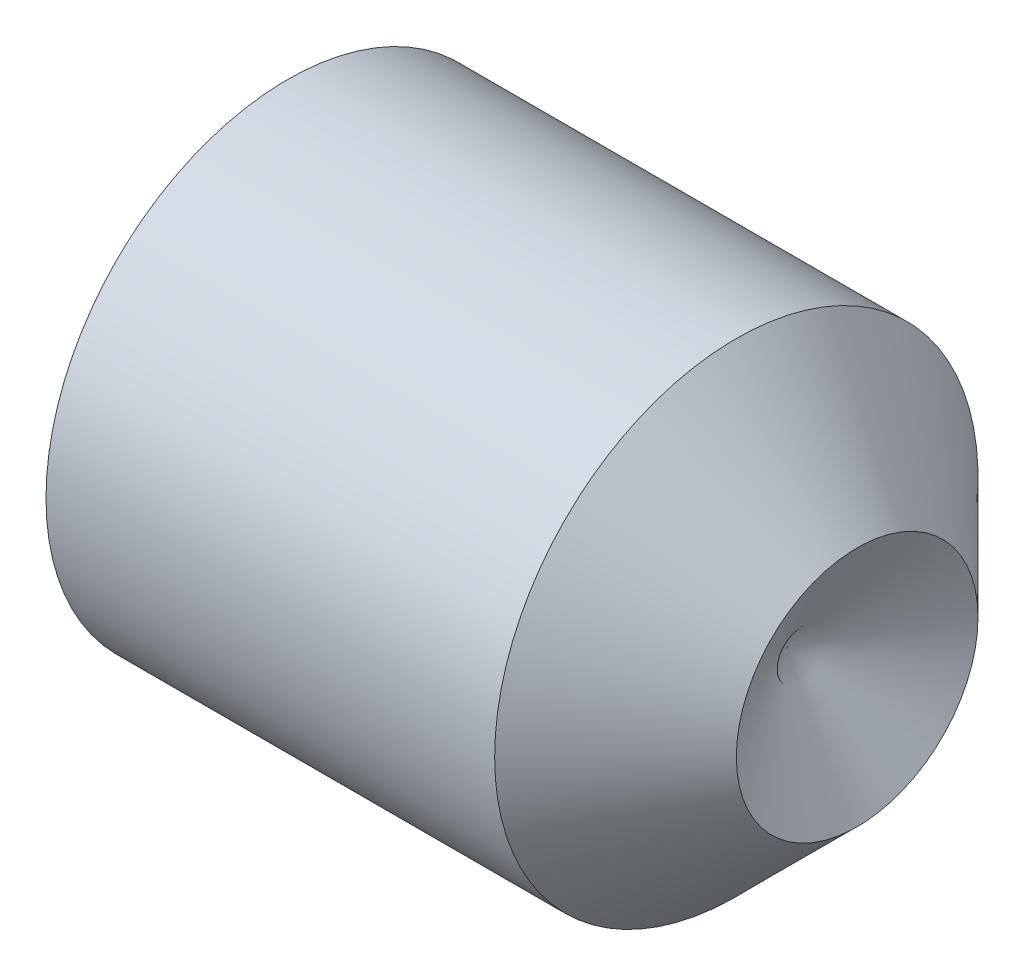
ISO-10303-21;
HEADER;
FILE_DESCRIPTION(('STEP AP214'),'2;1');
FILE_NAME('part.step','',(''),(''),'','','');
FILE_SCHEMA(('AUTOMOTIVE_DESIGN { 1 0 10303 214 1 1 1 1 }'));
ENDSEC;
DATA;
#1=APPLICATION_CONTEXT('core data for automotive mechanical design processes');
#2=APPLICATION_PROTOCOL_DEFINITION('international standard','automotive_design',2000,#1);
#3=PRODUCT_CONTEXT('',#1,'mechanical');
#4=PRODUCT('Part','Part','',(#3));
#5=PRODUCT_RELATED_PRODUCT_CATEGORY('part','',(#4));
#6=PRODUCT_DEFINITION_FORMATION('','',#4);
#7=PRODUCT_DEFINITION_CONTEXT('part definition',#1,'design');
#8=PRODUCT_DEFINITION('design','',#6,#7);
#9=PRODUCT_DEFINITION_SHAPE('','',#8);
#10=(LENGTH_UNIT() NAMED_UNIT(*) SI_UNIT(.MILLI.,.METRE.));
#11=(NAMED_UNIT(*) PLANE_ANGLE_UNIT() SI_UNIT($,.RADIAN.));
#12=(NAMED_UNIT(*) SI_UNIT($,.STERADIAN.) SOLID_ANGLE_UNIT());
#13=UNCERTAINTY_MEASURE_WITH_UNIT(LENGTH_MEASURE(1.E-05),#10,'distance_accuracy_value','');
#14=(GEOMETRIC_REPRESENTATION_CONTEXT(3) GLOBAL_UNCERTAINTY_ASSIGNED_CONTEXT((#13)) GLOBAL_UNIT_ASSIGNED_CONTEXT((#10,
#11,#12)) REPRESENTATION_CONTEXT('',''));
#15=CARTESIAN_POINT('',(0.,0.,0.));
#16=DIRECTION('',(0.,0.,1.));
#17=DIRECTION('',(1.,0.,0.));
#18=AXIS2_PLACEMENT_3D('',#15,#16,#17);
#19=CARTESIAN_POINT('',(0.,0.,0.));
#20=DIRECTION('',(-1.,0.,0.));
#21=DIRECTION('',(0.,0.,1.));
#22=AXIS2_PLACEMENT_3D('',#19,#20,#21);
#23=CYLINDRICAL_SURFACE('',#22,0.799999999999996);
#24=CARTESIAN_POINT('',(1.6,0.,0.));
#25=DIRECTION('',(-1.,0.,0.));
#26=DIRECTION('',(0.,0.,1.));
#27=AXIS2_PLACEMENT_3D('',#24,#25,#26);
#28=CIRCLE('',#27,0.8);
#29=CARTESIAN_POINT('',(1.6,0.,0.8));
#30=VERTEX_POINT('',#29);
#31=EDGE_CURVE('E11',#30,#30,#28,.T.);
#32=ORIENTED_EDGE('',*,*,#31,.T.);
#33=EDGE_LOOP('',(#32));
#34=FACE_BOUND('',#33,.T.);
#35=CARTESIAN_POINT('',(0.114892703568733,0.,0.));
#36=DIRECTION('',(-1.,0.,0.));
#37=DIRECTION('',(0.,0.,1.));
#38=AXIS2_PLACEMENT_3D('',#35,#36,#37);
#39=CIRCLE('',#38,0.799999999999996);
#40=CARTESIAN_POINT('',(0.114892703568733,0.,0.799999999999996));
#41=VERTEX_POINT('',#40);
#42=EDGE_CURVE('E52',#41,#41,#39,.T.);
#43=ORIENTED_EDGE('',*,*,#42,.F.);
#44=EDGE_LOOP('',(#43));
#45=FACE_BOUND('',#44,.T.);
#46=ADVANCED_FACE('F44',(#34,#45),#23,.T.);
#47=CARTESIAN_POINT('',(2.,0.,0.));
#48=DIRECTION('',(-1.,0.,0.));
#49=DIRECTION('',(0.,0.,1.));
#50=AXIS2_PLACEMENT_3D('',#47,#48,#49);
#51=CONICAL_SURFACE('',#50,0.4,0.785398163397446);
#52=ORIENTED_EDGE('',*,*,#31,.F.);
#53=EDGE_LOOP('',(#52));
#54=FACE_BOUND('',#53,.T.);
#55=CARTESIAN_POINT('',(2.,0.,0.));
#56=DIRECTION('',(-1.,0.,0.));
#57=DIRECTION('',(0.,0.,1.));
#58=AXIS2_PLACEMENT_3D('',#55,#56,#57);
#59=CIRCLE('',#58,0.4);
#60=CARTESIAN_POINT('',(2.,0.,0.4));
#61=VERTEX_POINT('',#60);
#62=EDGE_CURVE('E140',#61,#61,#59,.T.);
#63=ORIENTED_EDGE('',*,*,#62,.T.);
#64=EDGE_LOOP('',(#63));
#65=FACE_BOUND('',#64,.T.);
#66=ADVANCED_FACE('F165',(#54,#65),#51,.T.);
#67=CARTESIAN_POINT('',(0.,0.,0.));
#68=DIRECTION('',(1.,0.,0.));
#69=DIRECTION('',(0.,0.,-1.));
#70=AXIS2_PLACEMENT_3D('',#67,#68,#69);
#71=CONICAL_SURFACE('',#70,0.601,1.0471975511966);
#72=ORIENTED_EDGE('',*,*,#42,.T.);
#73=EDGE_LOOP('',(#72));
#74=FACE_BOUND('',#73,.T.);
#75=CARTESIAN_POINT('',(0.,0.,0.));
#76=DIRECTION('',(-1.,0.,0.));
#77=DIRECTION('',(0.,0.,1.));
#78=AXIS2_PLACEMENT_3D('',#75,#76,#77);
#79=CIRCLE('',#78,0.601);
#80=CARTESIAN_POINT('',(0.,0.,0.601));
#81=VERTEX_POINT('',#80);
#82=EDGE_CURVE('E150',#81,#81,#79,.T.);
#83=ORIENTED_EDGE('',*,*,#82,.F.);
#84=EDGE_LOOP('',(#83));
#85=FACE_BOUND('',#84,.T.);
#86=ADVANCED_FACE('F159',(#74,#85),#71,.T.);
#87=CARTESIAN_POINT('',(0.,0.799999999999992,0.));
#88=DIRECTION('',(1.,0.,0.));
#89=DIRECTION('',(0.,0.,-1.));
#90=AXIS2_PLACEMENT_3D('',#87,#88,#89);
#91=PLANE('',#90);
#92=DIRECTION('',(0.,-0.5,-0.866025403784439));
#93=VECTOR('',#92,1.);
#94=CARTESIAN_POINT('',(0.,0.404145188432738,0.));
#95=LINE('',#94,#93);
#96=CARTESIAN_POINT('',(0.,0.404145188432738,0.));
#97=VERTEX_POINT('',#96);
#98=CARTESIAN_POINT('',(0.,0.202072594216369,-0.35));
#99=VERTEX_POINT('',#98);
#100=EDGE_CURVE('E138',#97,#99,#95,.T.);
#101=ORIENTED_EDGE('',*,*,#100,.F.);
#102=DIRECTION('',(0.,0.5,-0.866025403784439));
#103=VECTOR('',#102,1.);
#104=CARTESIAN_POINT('',(0.,0.202072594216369,0.35));
#105=LINE('',#104,#103);
#106=CARTESIAN_POINT('',(0.,0.202072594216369,0.35));
#107=VERTEX_POINT('',#106);
#108=EDGE_CURVE('E58',#107,#97,#105,.T.);
#109=ORIENTED_EDGE('',*,*,#108,.F.);
#110=DIRECTION('',(0.,1.,0.));
#111=VECTOR('',#110,1.);
#112=CARTESIAN_POINT('',(0.,-0.202072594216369,0.35));
#113=LINE('',#112,#111);
#114=CARTESIAN_POINT('',(0.,-0.202072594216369,0.35));
#115=VERTEX_POINT('',#114);
#116=EDGE_CURVE('E146',#115,#107,#113,.T.);
#117=ORIENTED_EDGE('',*,*,#116,.F.);
#118=DIRECTION('',(0.,0.5,0.866025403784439));
#119=VECTOR('',#118,1.);
#120=CARTESIAN_POINT('',(0.,-0.404145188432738,0.));
#121=LINE('',#120,#119);
#122=CARTESIAN_POINT('',(0.,-0.404145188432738,0.));
#123=VERTEX_POINT('',#122);
#124=EDGE_CURVE('E144',#123,#115,#121,.T.);
#125=ORIENTED_EDGE('',*,*,#124,.F.);
#126=DIRECTION('',(0.,-0.5,0.866025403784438));
#127=VECTOR('',#126,1.);
#128=CARTESIAN_POINT('',(0.,-0.202072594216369,-0.35));
#129=LINE('',#128,#127);
#130=CARTESIAN_POINT('',(0.,-0.202072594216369,-0.35));
#131=VERTEX_POINT('',#130);
#132=EDGE_CURVE('E109',#131,#123,#129,.T.);
#133=ORIENTED_EDGE('',*,*,#132,.F.);
#134=DIRECTION('',(0.,-1.,0.));
#135=VECTOR('',#134,1.);
#136=CARTESIAN_POINT('',(0.,0.202072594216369,-0.35));
#137=LINE('',#136,#135);
#138=EDGE_CURVE('E139',#99,#131,#137,.T.);
#139=ORIENTED_EDGE('',*,*,#138,.F.);
#140=EDGE_LOOP('',(#101,#109,#117,#125,#133,#139));
#141=FACE_BOUND('',#140,.T.);
#142=ORIENTED_EDGE('',*,*,#82,.T.);
#143=EDGE_LOOP('',(#142));
#144=FACE_BOUND('',#143,.T.);
#145=ADVANCED_FACE('F50',(#141,#144),#91,.F.);
#146=CARTESIAN_POINT('',(0.7,0.202072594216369,0.35));
#147=DIRECTION('',(0.,0.866025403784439,0.5));
#148=DIRECTION('',(0.,-0.5,0.866025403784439));
#149=AXIS2_PLACEMENT_3D('',#146,#147,#148);
#150=PLANE('',#149);
#151=ORIENTED_EDGE('',*,*,#108,.T.);
#152=DIRECTION('',(-1.,0.,0.));
#153=VECTOR('',#152,1.);
#154=CARTESIAN_POINT('',(0.7,0.404145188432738,0.));
#155=LINE('',#154,#153);
#156=CARTESIAN_POINT('',(0.7,0.404145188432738,0.));
#157=VERTEX_POINT('',#156);
#158=EDGE_CURVE('E93',#157,#97,#155,.T.);
#159=ORIENTED_EDGE('',*,*,#158,.F.);
#160=DIRECTION('',(0.,0.5,-0.866025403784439));
#161=VECTOR('',#160,1.);
#162=CARTESIAN_POINT('',(0.7,0.202072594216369,0.35));
#163=LINE('',#162,#161);
#164=CARTESIAN_POINT('',(0.7,0.202072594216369,0.35));
#165=VERTEX_POINT('',#164);
#166=EDGE_CURVE('E149',#165,#157,#163,.T.);
#167=ORIENTED_EDGE('',*,*,#166,.F.);
#168=DIRECTION('',(-1.,0.,0.));
#169=VECTOR('',#168,1.);
#170=CARTESIAN_POINT('',(0.7,0.202072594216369,0.35));
#171=LINE('',#170,#169);
#172=EDGE_CURVE('E66',#165,#107,#171,.T.);
#173=ORIENTED_EDGE('',*,*,#172,.T.);
#174=EDGE_LOOP('',(#151,#159,#167,#173));
#175=FACE_BOUND('',#174,.T.);
#176=ADVANCED_FACE('F172',(#175),#150,.F.);
#177=CARTESIAN_POINT('',(0.7,-0.202072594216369,0.35));
#178=DIRECTION('',(0.,0.,1.));
#179=DIRECTION('',(0.,-1.,0.));
#180=AXIS2_PLACEMENT_3D('',#177,#178,#179);
#181=PLANE('',#180);
#182=ORIENTED_EDGE('',*,*,#116,.T.);
#183=ORIENTED_EDGE('',*,*,#172,.F.);
#184=DIRECTION('',(0.,1.,0.));
#185=VECTOR('',#184,1.);
#186=CARTESIAN_POINT('',(0.7,-0.202072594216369,0.35));
#187=LINE('',#186,#185);
#188=CARTESIAN_POINT('',(0.7,-0.202072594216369,0.35));
#189=VERTEX_POINT('',#188);
#190=EDGE_CURVE('E125',#189,#165,#187,.T.);
#191=ORIENTED_EDGE('',*,*,#190,.F.);
#192=DIRECTION('',(-1.,0.,0.));
#193=VECTOR('',#192,1.);
#194=CARTESIAN_POINT('',(0.7,-0.202072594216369,0.35));
#195=LINE('',#194,#193);
#196=EDGE_CURVE('E112',#189,#115,#195,.T.);
#197=ORIENTED_EDGE('',*,*,#196,.T.);
#198=EDGE_LOOP('',(#182,#183,#191,#197));
#199=FACE_BOUND('',#198,.T.);
#200=ADVANCED_FACE('F180',(#199),#181,.F.);
#201=CARTESIAN_POINT('',(0.7,-0.404145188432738,0.));
#202=DIRECTION('',(0.,-0.866025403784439,0.5));
#203=DIRECTION('',(0.,-0.5,-0.866025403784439));
#204=AXIS2_PLACEMENT_3D('',#201,#202,#203);
#205=PLANE('',#204);
#206=ORIENTED_EDGE('',*,*,#124,.T.);
#207=ORIENTED_EDGE('',*,*,#196,.F.);
#208=DIRECTION('',(0.,0.5,0.866025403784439));
#209=VECTOR('',#208,1.);
#210=CARTESIAN_POINT('',(0.7,-0.404145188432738,0.));
#211=LINE('',#210,#209);
#212=CARTESIAN_POINT('',(0.7,-0.404145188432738,0.));
#213=VERTEX_POINT('',#212);
#214=EDGE_CURVE('E117',#213,#189,#211,.T.);
#215=ORIENTED_EDGE('',*,*,#214,.F.);
#216=DIRECTION('',(-1.,0.,0.));
#217=VECTOR('',#216,1.);
#218=CARTESIAN_POINT('',(0.7,-0.404145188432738,0.));
#219=LINE('',#218,#217);
#220=EDGE_CURVE('E101',#213,#123,#219,.T.);
#221=ORIENTED_EDGE('',*,*,#220,.T.);
#222=EDGE_LOOP('',(#206,#207,#215,#221));
#223=FACE_BOUND('',#222,.T.);
#224=ADVANCED_FACE('F118',(#223),#205,.F.);
#225=CARTESIAN_POINT('',(0.7,-0.202072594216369,-0.35));
#226=DIRECTION('',(0.,-0.866025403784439,-0.5));
#227=DIRECTION('',(0.,0.5,-0.866025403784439));
#228=AXIS2_PLACEMENT_3D('',#225,#226,#227);
#229=PLANE('',#228);
#230=ORIENTED_EDGE('',*,*,#132,.T.);
#231=ORIENTED_EDGE('',*,*,#220,.F.);
#232=DIRECTION('',(0.,-0.5,0.866025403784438));
#233=VECTOR('',#232,1.);
#234=CARTESIAN_POINT('',(0.7,-0.202072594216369,-0.35));
#235=LINE('',#234,#233);
#236=CARTESIAN_POINT('',(0.7,-0.202072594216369,-0.35));
#237=VERTEX_POINT('',#236);
#238=EDGE_CURVE('E110',#237,#213,#235,.T.);
#239=ORIENTED_EDGE('',*,*,#238,.F.);
#240=DIRECTION('',(-1.,0.,0.));
#241=VECTOR('',#240,1.);
#242=CARTESIAN_POINT('',(0.7,-0.202072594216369,-0.35));
#243=LINE('',#242,#241);
#244=EDGE_CURVE('E114',#237,#131,#243,.T.);
#245=ORIENTED_EDGE('',*,*,#244,.T.);
#246=EDGE_LOOP('',(#230,#231,#239,#245));
#247=FACE_BOUND('',#246,.T.);
#248=ADVANCED_FACE('F102',(#247),#229,.F.);
#249=CARTESIAN_POINT('',(0.7,0.202072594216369,-0.35));
#250=DIRECTION('',(0.,0.,-1.));
#251=DIRECTION('',(-1.,0.,0.));
#252=AXIS2_PLACEMENT_3D('',#249,#250,#251);
#253=PLANE('',#252);
#254=ORIENTED_EDGE('',*,*,#138,.T.);
#255=ORIENTED_EDGE('',*,*,#244,.F.);
#256=DIRECTION('',(0.,-1.,0.));
#257=VECTOR('',#256,1.);
#258=CARTESIAN_POINT('',(0.7,0.202072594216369,-0.35));
#259=LINE('',#258,#257);
#260=CARTESIAN_POINT('',(0.7,0.202072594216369,-0.35));
#261=VERTEX_POINT('',#260);
#262=EDGE_CURVE('E129',#261,#237,#259,.T.);
#263=ORIENTED_EDGE('',*,*,#262,.F.);
#264=DIRECTION('',(-1.,0.,0.));
#265=VECTOR('',#264,1.);
#266=CARTESIAN_POINT('',(0.7,0.202072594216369,-0.35));
#267=LINE('',#266,#265);
#268=EDGE_CURVE('E151',#261,#99,#267,.T.);
#269=ORIENTED_EDGE('',*,*,#268,.T.);
#270=EDGE_LOOP('',(#254,#255,#263,#269));
#271=FACE_BOUND('',#270,.T.);
#272=ADVANCED_FACE('F181',(#271),#253,.F.);
#273=CARTESIAN_POINT('',(0.7,0.404145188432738,0.));
#274=DIRECTION('',(0.,0.866025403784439,-0.5));
#275=DIRECTION('',(0.,0.5,0.866025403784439));
#276=AXIS2_PLACEMENT_3D('',#273,#274,#275);
#277=PLANE('',#276);
#278=ORIENTED_EDGE('',*,*,#100,.T.);
#279=ORIENTED_EDGE('',*,*,#268,.F.);
#280=DIRECTION('',(0.,-0.5,-0.866025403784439));
#281=VECTOR('',#280,1.);
#282=CARTESIAN_POINT('',(0.7,0.404145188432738,0.));
#283=LINE('',#282,#281);
#284=EDGE_CURVE('E130',#157,#261,#283,.T.);
#285=ORIENTED_EDGE('',*,*,#284,.F.);
#286=ORIENTED_EDGE('',*,*,#158,.T.);
#287=EDGE_LOOP('',(#278,#279,#285,#286));
#288=FACE_BOUND('',#287,.T.);
#289=ADVANCED_FACE('F178',(#288),#277,.F.);
#290=CARTESIAN_POINT('',(0.7,0.202072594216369,0.35));
#291=DIRECTION('',(1.,0.,0.));
#292=DIRECTION('',(0.,0.,-1.));
#293=AXIS2_PLACEMENT_3D('',#290,#291,#292);
#294=PLANE('',#293);
#295=ORIENTED_EDGE('',*,*,#166,.T.);
#296=ORIENTED_EDGE('',*,*,#284,.T.);
#297=ORIENTED_EDGE('',*,*,#262,.T.);
#298=ORIENTED_EDGE('',*,*,#238,.T.);
#299=ORIENTED_EDGE('',*,*,#214,.T.);
#300=ORIENTED_EDGE('',*,*,#190,.T.);
#301=EDGE_LOOP('',(#295,#296,#297,#298,#299,#300));
#302=FACE_BOUND('',#301,.T.);
#303=ADVANCED_FACE('F123',(#302),#294,.F.);
#304=CARTESIAN_POINT('',(2.,0.,0.));
#305=DIRECTION('',(1.,0.,0.));
#306=DIRECTION('',(0.,0.,-1.));
#307=AXIS2_PLACEMENT_3D('',#304,#305,#306);
#308=CONICAL_SURFACE('',#307,0.4,1.04719755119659);
#309=CARTESIAN_POINT('',(1.76905989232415,0.,0.));
#310=VERTEX_POINT('',#309);
#311=VERTEX_LOOP('',#310);
#312=FACE_BOUND('',#311,.T.);
#313=ORIENTED_EDGE('',*,*,#62,.F.);
#314=EDGE_LOOP('',(#313));
#315=FACE_BOUND('',#314,.T.);
#316=ADVANCED_FACE('F193',(#312,#315),#308,.F.);
#317=CLOSED_SHELL('',(#46,#66,#86,#145,#176,#200,#224,#248,#272,#289,#303,#316));
#318=MANIFOLD_SOLID_BREP('B2',#317);
#319=ADVANCED_BREP_SHAPE_REPRESENTATION('',(#18,#318),#14);
#320=SHAPE_DEFINITION_REPRESENTATION(#9,#319);
ENDSEC;
END-ISO-10303-21;
